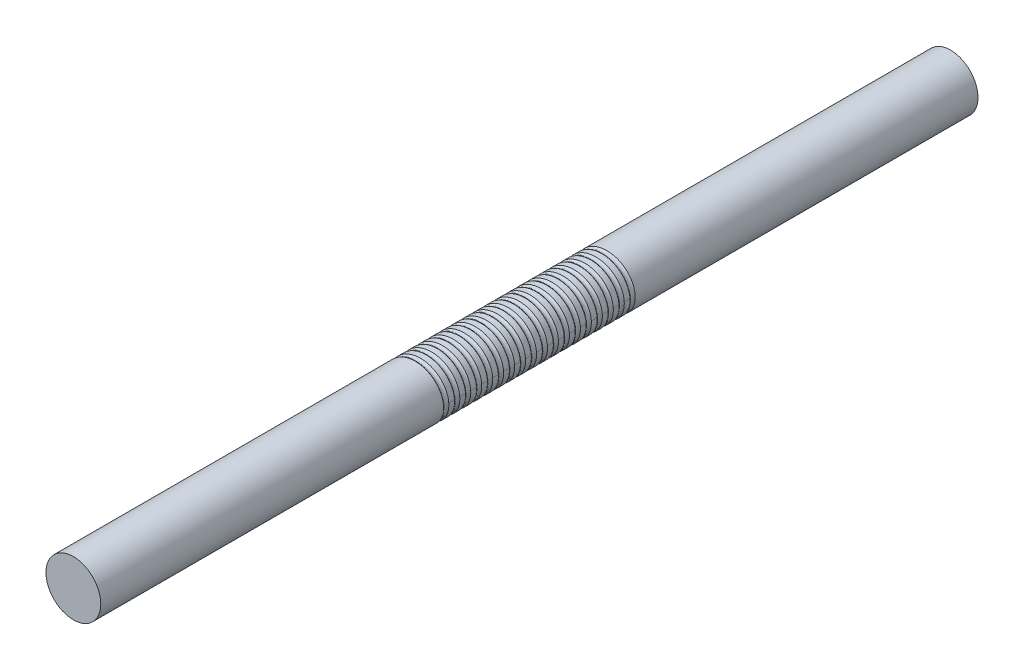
from build123d import *

# Parameters (mm, degrees)
SKETCH1_R              = 25
BOSS_EXTRUDE1_DEPTH    = 800
CUT_SWEEP1_PITCH       = 10
CUT_SWEEP1_HEIGHT      = 180
CUT_SWEEP1_RADIUS      = 27.116666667
CUT_SWEEP1_START_ANGLE = -180
SKETCH3_R              = 3.175


with BuildPart() as part:
    # Sketch1 → Boss-Extrude1 (new body)
    with BuildSketch(Plane.XY):
        Circle(SKETCH1_R)
    extrude(amount=BOSS_EXTRUDE1_DEPTH)

    # Cut-Sweep1: sweep along a helix
    with BuildLine() as cut_sweep1_path:
        add(Helix(CUT_SWEEP1_PITCH, CUT_SWEEP1_HEIGHT, CUT_SWEEP1_RADIUS, center=(0, 0, 310), direction=(0, 0, 1), mode=Mode.PRIVATE).rotate(Axis((0, 0, 310), (0, 0, 1)), CUT_SWEEP1_START_ANGLE))
    # Sketch3 → Cut-Sweep1 (sweep, cut)
    with BuildSketch(Plane(origin=(0, 0, 0), x_dir=(1, 0, 0), z_dir=(0, 1, 0))):
        with Locations((-27.116666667, -310)):
            Circle(SKETCH3_R)
    sweep(path=cut_sweep1_path.line, is_frenet=True, mode=Mode.SUBTRACT)


solid = part.part
